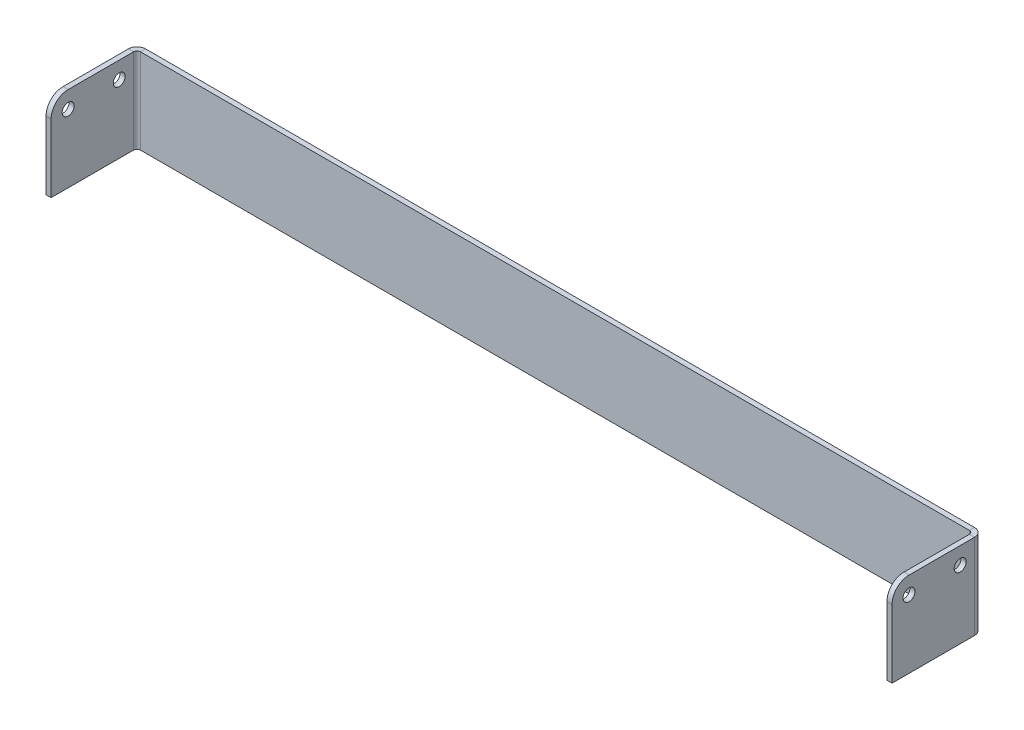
ISO-10303-21;
HEADER;
FILE_DESCRIPTION(('STEP AP214'),'2;1');
FILE_NAME('part.step','',(''),(''),'','','');
FILE_SCHEMA(('AUTOMOTIVE_DESIGN { 1 0 10303 214 1 1 1 1 }'));
ENDSEC;
DATA;
#1=APPLICATION_CONTEXT('core data for automotive mechanical design processes');
#2=APPLICATION_PROTOCOL_DEFINITION('international standard','automotive_design',2000,#1);
#3=PRODUCT_CONTEXT('',#1,'mechanical');
#4=PRODUCT('Part','Part','',(#3));
#5=PRODUCT_RELATED_PRODUCT_CATEGORY('part','',(#4));
#6=PRODUCT_DEFINITION_FORMATION('','',#4);
#7=PRODUCT_DEFINITION_CONTEXT('part definition',#1,'design');
#8=PRODUCT_DEFINITION('design','',#6,#7);
#9=PRODUCT_DEFINITION_SHAPE('','',#8);
#10=(LENGTH_UNIT() NAMED_UNIT(*) SI_UNIT(.MILLI.,.METRE.));
#11=(NAMED_UNIT(*) PLANE_ANGLE_UNIT() SI_UNIT($,.RADIAN.));
#12=(NAMED_UNIT(*) SI_UNIT($,.STERADIAN.) SOLID_ANGLE_UNIT());
#13=UNCERTAINTY_MEASURE_WITH_UNIT(LENGTH_MEASURE(1.E-05),#10,'distance_accuracy_value','');
#14=(GEOMETRIC_REPRESENTATION_CONTEXT(3) GLOBAL_UNCERTAINTY_ASSIGNED_CONTEXT((#13)) GLOBAL_UNIT_ASSIGNED_CONTEXT((#10,
#11,#12)) REPRESENTATION_CONTEXT('',''));
#15=CARTESIAN_POINT('',(0.,0.,0.));
#16=DIRECTION('',(0.,0.,1.));
#17=DIRECTION('',(1.,0.,0.));
#18=AXIS2_PLACEMENT_3D('',#15,#16,#17);
#19=CARTESIAN_POINT('',(5.,20.,0.));
#20=DIRECTION('',(0.,0.,-1.));
#21=DIRECTION('',(-1.,0.,0.));
#22=AXIS2_PLACEMENT_3D('',#19,#20,#21);
#23=PLANE('',#22);
#24=DIRECTION('',(-1.,0.,0.));
#25=VECTOR('',#24,1.);
#26=CARTESIAN_POINT('',(5.00000000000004,25.,0.));
#27=LINE('',#26,#25);
#28=CARTESIAN_POINT('',(269.21459005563,25.,0.));
#29=VERTEX_POINT('',#28);
#30=CARTESIAN_POINT('',(25.7854099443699,25.,0.));
#31=VERTEX_POINT('',#30);
#32=EDGE_CURVE('E58',#29,#31,#27,.T.);
#33=ORIENTED_EDGE('',*,*,#32,.F.);
#34=DIRECTION('',(0.,-1.,0.));
#35=VECTOR('',#34,1.);
#36=CARTESIAN_POINT('',(269.21459005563,20.,0.));
#37=LINE('',#36,#35);
#38=CARTESIAN_POINT('',(269.21459005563,0.,0.));
#39=VERTEX_POINT('',#38);
#40=EDGE_CURVE('E50',#29,#39,#37,.T.);
#41=ORIENTED_EDGE('',*,*,#40,.T.);
#42=DIRECTION('',(1.,0.,0.));
#43=VECTOR('',#42,1.);
#44=CARTESIAN_POINT('',(0.,0.,0.));
#45=LINE('',#44,#43);
#46=CARTESIAN_POINT('',(25.7854099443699,0.,0.));
#47=VERTEX_POINT('',#46);
#48=EDGE_CURVE('E66',#47,#39,#45,.T.);
#49=ORIENTED_EDGE('',*,*,#48,.F.);
#50=DIRECTION('',(0.,-1.,0.));
#51=VECTOR('',#50,1.);
#52=CARTESIAN_POINT('',(25.7854099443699,20.,0.));
#53=LINE('',#52,#51);
#54=EDGE_CURVE('E264',#31,#47,#53,.T.);
#55=ORIENTED_EDGE('',*,*,#54,.F.);
#56=EDGE_LOOP('',(#33,#41,#49,#55));
#57=FACE_BOUND('',#56,.T.);
#58=ADVANCED_FACE('F41',(#57),#23,.T.);
#59=CARTESIAN_POINT('',(5.00000000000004,25.,1.5));
#60=DIRECTION('',(0.,-1.,0.));
#61=DIRECTION('',(0.,0.,-1.));
#62=AXIS2_PLACEMENT_3D('',#59,#60,#61);
#63=PLANE('',#62);
#64=DIRECTION('',(0.,0.,1.));
#65=VECTOR('',#64,1.);
#66=CARTESIAN_POINT('',(269.21459005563,25.,1.5));
#67=LINE('',#66,#65);
#68=CARTESIAN_POINT('',(269.21459005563,25.,1.5));
#69=VERTEX_POINT('',#68);
#70=EDGE_CURVE('E12',#29,#69,#67,.T.);
#71=ORIENTED_EDGE('',*,*,#70,.F.);
#72=ORIENTED_EDGE('',*,*,#32,.T.);
#73=DIRECTION('',(0.,0.,1.));
#74=VECTOR('',#73,1.);
#75=CARTESIAN_POINT('',(25.7854099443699,25.,1.5));
#76=LINE('',#75,#74);
#77=CARTESIAN_POINT('',(25.7854099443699,25.,1.5));
#78=VERTEX_POINT('',#77);
#79=EDGE_CURVE('E261',#31,#78,#76,.T.);
#80=ORIENTED_EDGE('',*,*,#79,.T.);
#81=DIRECTION('',(-1.,0.,0.));
#82=VECTOR('',#81,1.);
#83=CARTESIAN_POINT('',(5.00000000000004,25.,1.5));
#84=LINE('',#83,#82);
#85=EDGE_CURVE('E45',#69,#78,#84,.T.);
#86=ORIENTED_EDGE('',*,*,#85,.F.);
#87=EDGE_LOOP('',(#71,#72,#80,#86));
#88=FACE_BOUND('',#87,.T.);
#89=ADVANCED_FACE('F43',(#88),#63,.F.);
#90=CARTESIAN_POINT('',(0.,0.,1.5));
#91=DIRECTION('',(0.,1.,0.));
#92=DIRECTION('',(0.,0.,1.));
#93=AXIS2_PLACEMENT_3D('',#90,#91,#92);
#94=PLANE('',#93);
#95=DIRECTION('',(0.,0.,-1.));
#96=VECTOR('',#95,1.);
#97=CARTESIAN_POINT('',(269.21459005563,0.,1.5));
#98=LINE('',#97,#96);
#99=CARTESIAN_POINT('',(269.21459005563,0.,1.5));
#100=VERTEX_POINT('',#99);
#101=EDGE_CURVE('E271',#100,#39,#98,.T.);
#102=ORIENTED_EDGE('',*,*,#101,.F.);
#103=DIRECTION('',(1.,0.,0.));
#104=VECTOR('',#103,1.);
#105=CARTESIAN_POINT('',(0.,0.,1.5));
#106=LINE('',#105,#104);
#107=CARTESIAN_POINT('',(25.7854099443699,0.,1.5));
#108=VERTEX_POINT('',#107);
#109=EDGE_CURVE('E276',#108,#100,#106,.T.);
#110=ORIENTED_EDGE('',*,*,#109,.F.);
#111=DIRECTION('',(0.,0.,-1.));
#112=VECTOR('',#111,1.);
#113=CARTESIAN_POINT('',(25.7854099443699,0.,1.5));
#114=LINE('',#113,#112);
#115=EDGE_CURVE('E266',#108,#47,#114,.T.);
#116=ORIENTED_EDGE('',*,*,#115,.T.);
#117=ORIENTED_EDGE('',*,*,#48,.T.);
#118=EDGE_LOOP('',(#102,#110,#116,#117));
#119=FACE_BOUND('',#118,.T.);
#120=ADVANCED_FACE('F323',(#119),#94,.F.);
#121=CARTESIAN_POINT('',(5.,20.,1.5));
#122=DIRECTION('',(0.,0.,-1.));
#123=DIRECTION('',(-1.,0.,0.));
#124=AXIS2_PLACEMENT_3D('',#121,#122,#123);
#125=PLANE('',#124);
#126=DIRECTION('',(0.,-1.,0.));
#127=VECTOR('',#126,1.);
#128=CARTESIAN_POINT('',(269.21459005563,20.,1.5));
#129=LINE('',#128,#127);
#130=EDGE_CURVE('E268',#69,#100,#129,.T.);
#131=ORIENTED_EDGE('',*,*,#130,.F.);
#132=ORIENTED_EDGE('',*,*,#85,.T.);
#133=DIRECTION('',(0.,-1.,0.));
#134=VECTOR('',#133,1.);
#135=CARTESIAN_POINT('',(25.7854099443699,20.,1.5));
#136=LINE('',#135,#134);
#137=EDGE_CURVE('E258',#78,#108,#136,.T.);
#138=ORIENTED_EDGE('',*,*,#137,.T.);
#139=ORIENTED_EDGE('',*,*,#109,.T.);
#140=EDGE_LOOP('',(#131,#132,#138,#139));
#141=FACE_BOUND('',#140,.T.);
#142=ADVANCED_FACE('F281',(#141),#125,.F.);
#143=CARTESIAN_POINT('',(25.7854099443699,25.,2.5));
#144=DIRECTION('',(0.,-1.,0.));
#145=DIRECTION('',(0.,0.,-1.));
#146=AXIS2_PLACEMENT_3D('',#143,#144,#145);
#147=PLANE('',#146);
#148=ORIENTED_EDGE('',*,*,#79,.F.);
#149=CARTESIAN_POINT('',(25.7854099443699,25.,2.5));
#150=DIRECTION('',(0.,-1.,0.));
#151=DIRECTION('',(1.,0.,0.));
#152=AXIS2_PLACEMENT_3D('',#149,#150,#151);
#153=CIRCLE('',#152,2.5);
#154=CARTESIAN_POINT('',(23.2854099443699,25.,2.50000000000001));
#155=VERTEX_POINT('',#154);
#156=EDGE_CURVE('E197',#31,#155,#153,.F.);
#157=ORIENTED_EDGE('',*,*,#156,.T.);
#158=DIRECTION('',(1.,0.,0.));
#159=VECTOR('',#158,1.);
#160=CARTESIAN_POINT('',(24.7854099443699,25.,2.5));
#161=LINE('',#160,#159);
#162=CARTESIAN_POINT('',(24.7854099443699,25.,2.5));
#163=VERTEX_POINT('',#162);
#164=EDGE_CURVE('E239',#155,#163,#161,.T.);
#165=ORIENTED_EDGE('',*,*,#164,.T.);
#166=CARTESIAN_POINT('',(25.7854099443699,25.,2.5));
#167=DIRECTION('',(0.,1.,0.));
#168=DIRECTION('',(0.,0.,1.));
#169=AXIS2_PLACEMENT_3D('',#166,#167,#168);
#170=CIRCLE('',#169,1.);
#171=EDGE_CURVE('E247',#78,#163,#170,.T.);
#172=ORIENTED_EDGE('',*,*,#171,.F.);
#173=EDGE_LOOP('',(#148,#157,#165,#172));
#174=FACE_BOUND('',#173,.T.);
#175=ADVANCED_FACE('F286',(#174),#147,.F.);
#176=CARTESIAN_POINT('',(25.7854099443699,0.,2.5));
#177=DIRECTION('',(0.,1.,0.));
#178=DIRECTION('',(-1.,0.,0.));
#179=AXIS2_PLACEMENT_3D('',#176,#177,#178);
#180=PLANE('',#179);
#181=DIRECTION('',(-1.,0.,0.));
#182=VECTOR('',#181,1.);
#183=CARTESIAN_POINT('',(24.7854099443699,0.,2.5));
#184=LINE('',#183,#182);
#185=CARTESIAN_POINT('',(24.7854099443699,0.,2.50000000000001));
#186=VERTEX_POINT('',#185);
#187=CARTESIAN_POINT('',(23.2854099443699,0.,2.50000000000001));
#188=VERTEX_POINT('',#187);
#189=EDGE_CURVE('E242',#186,#188,#184,.T.);
#190=ORIENTED_EDGE('',*,*,#189,.T.);
#191=CARTESIAN_POINT('',(25.7854099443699,0.,2.5));
#192=DIRECTION('',(0.,-1.,0.));
#193=DIRECTION('',(1.,0.,0.));
#194=AXIS2_PLACEMENT_3D('',#191,#192,#193);
#195=CIRCLE('',#194,2.5);
#196=EDGE_CURVE('E251',#188,#47,#195,.T.);
#197=ORIENTED_EDGE('',*,*,#196,.T.);
#198=ORIENTED_EDGE('',*,*,#115,.F.);
#199=CARTESIAN_POINT('',(25.7854099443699,0.,2.5));
#200=DIRECTION('',(0.,-1.,0.));
#201=DIRECTION('',(1.,0.,0.));
#202=AXIS2_PLACEMENT_3D('',#199,#200,#201);
#203=CIRCLE('',#202,1.);
#204=EDGE_CURVE('E250',#186,#108,#203,.T.);
#205=ORIENTED_EDGE('',*,*,#204,.F.);
#206=EDGE_LOOP('',(#190,#197,#198,#205));
#207=FACE_BOUND('',#206,.T.);
#208=ADVANCED_FACE('F298',(#207),#180,.F.);
#209=CARTESIAN_POINT('',(25.7854099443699,37.5941721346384,2.5));
#210=DIRECTION('',(0.,-1.,0.));
#211=DIRECTION('',(1.,0.,0.));
#212=AXIS2_PLACEMENT_3D('',#209,#210,#211);
#213=CYLINDRICAL_SURFACE('',#212,1.);
#214=ORIENTED_EDGE('',*,*,#204,.T.);
#215=ORIENTED_EDGE('',*,*,#137,.F.);
#216=ORIENTED_EDGE('',*,*,#171,.T.);
#217=DIRECTION('',(0.,-1.,0.));
#218=VECTOR('',#217,1.);
#219=CARTESIAN_POINT('',(24.7854099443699,20.,2.5));
#220=LINE('',#219,#218);
#221=EDGE_CURVE('E189',#163,#186,#220,.T.);
#222=ORIENTED_EDGE('',*,*,#221,.T.);
#223=EDGE_LOOP('',(#214,#215,#216,#222));
#224=FACE_BOUND('',#223,.T.);
#225=ADVANCED_FACE('F308',(#224),#213,.F.);
#226=CARTESIAN_POINT('',(25.7854099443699,37.5941721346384,2.5));
#227=DIRECTION('',(0.,-1.,0.));
#228=DIRECTION('',(1.,0.,0.));
#229=AXIS2_PLACEMENT_3D('',#226,#227,#228);
#230=CYLINDRICAL_SURFACE('',#229,2.5);
#231=ORIENTED_EDGE('',*,*,#196,.F.);
#232=DIRECTION('',(0.,-1.,0.));
#233=VECTOR('',#232,1.);
#234=CARTESIAN_POINT('',(23.2854099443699,20.,2.50000000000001));
#235=LINE('',#234,#233);
#236=EDGE_CURVE('E201',#155,#188,#235,.T.);
#237=ORIENTED_EDGE('',*,*,#236,.F.);
#238=ORIENTED_EDGE('',*,*,#156,.F.);
#239=ORIENTED_EDGE('',*,*,#54,.T.);
#240=EDGE_LOOP('',(#231,#237,#238,#239));
#241=FACE_BOUND('',#240,.T.);
#242=ADVANCED_FACE('F290',(#241),#230,.T.);
#243=CARTESIAN_POINT('',(24.7854099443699,20.,6.71459005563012));
#244=DIRECTION('',(-1.,0.,0.));
#245=DIRECTION('',(0.,0.,1.));
#246=AXIS2_PLACEMENT_3D('',#243,#244,#245);
#247=CYLINDRICAL_SURFACE('',#246,1.75);
#248=CARTESIAN_POINT('',(24.7854099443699,20.,6.71459005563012));
#249=DIRECTION('',(1.,0.,0.));
#250=DIRECTION('',(0.,0.,-1.));
#251=AXIS2_PLACEMENT_3D('',#248,#249,#250);
#252=CIRCLE('',#251,1.75);
#253=CARTESIAN_POINT('',(24.7854099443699,20.,4.96459005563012));
#254=VERTEX_POINT('',#253);
#255=EDGE_CURVE('E236',#254,#254,#252,.T.);
#256=ORIENTED_EDGE('',*,*,#255,.T.);
#257=EDGE_LOOP('',(#256));
#258=FACE_BOUND('',#257,.T.);
#259=CARTESIAN_POINT('',(23.2854099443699,20.,6.71459005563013));
#260=DIRECTION('',(1.,0.,0.));
#261=DIRECTION('',(0.,0.,-1.));
#262=AXIS2_PLACEMENT_3D('',#259,#260,#261);
#263=CIRCLE('',#262,1.75);
#264=CARTESIAN_POINT('',(23.2854099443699,20.,4.96459005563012));
#265=VERTEX_POINT('',#264);
#266=EDGE_CURVE('E204',#265,#265,#263,.T.);
#267=ORIENTED_EDGE('',*,*,#266,.F.);
#268=EDGE_LOOP('',(#267));
#269=FACE_BOUND('',#268,.T.);
#270=ADVANCED_FACE('F315',(#258,#269),#247,.F.);
#271=CARTESIAN_POINT('',(24.78540994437,20.,21.7145900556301));
#272=DIRECTION('',(-1.,0.,0.));
#273=DIRECTION('',(0.,0.,1.));
#274=AXIS2_PLACEMENT_3D('',#271,#272,#273);
#275=CYLINDRICAL_SURFACE('',#274,1.75);
#276=CARTESIAN_POINT('',(24.78540994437,20.,21.7145900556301));
#277=DIRECTION('',(1.,0.,0.));
#278=DIRECTION('',(0.,0.,-1.));
#279=AXIS2_PLACEMENT_3D('',#276,#277,#278);
#280=CIRCLE('',#279,1.75);
#281=CARTESIAN_POINT('',(24.78540994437,20.,19.9645900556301));
#282=VERTEX_POINT('',#281);
#283=EDGE_CURVE('E233',#282,#282,#280,.T.);
#284=ORIENTED_EDGE('',*,*,#283,.T.);
#285=EDGE_LOOP('',(#284));
#286=FACE_BOUND('',#285,.T.);
#287=CARTESIAN_POINT('',(23.28540994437,20.,21.7145900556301));
#288=DIRECTION('',(1.,0.,0.));
#289=DIRECTION('',(0.,0.,-1.));
#290=AXIS2_PLACEMENT_3D('',#287,#288,#289);
#291=CIRCLE('',#290,1.75);
#292=CARTESIAN_POINT('',(23.28540994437,20.,19.9645900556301));
#293=VERTEX_POINT('',#292);
#294=EDGE_CURVE('E207',#293,#293,#291,.T.);
#295=ORIENTED_EDGE('',*,*,#294,.F.);
#296=EDGE_LOOP('',(#295));
#297=FACE_BOUND('',#296,.T.);
#298=ADVANCED_FACE('F361',(#286,#297),#275,.F.);
#299=CARTESIAN_POINT('',(24.78540994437,0.,26.7145900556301));
#300=DIRECTION('',(0.,0.,-1.));
#301=DIRECTION('',(-1.,0.,0.));
#302=AXIS2_PLACEMENT_3D('',#299,#300,#301);
#303=PLANE('',#302);
#304=DIRECTION('',(0.,-1.,0.));
#305=VECTOR('',#304,1.);
#306=CARTESIAN_POINT('',(23.28540994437,0.,26.7145900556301));
#307=LINE('',#306,#305);
#308=CARTESIAN_POINT('',(23.28540994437,19.9999999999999,26.7145900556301));
#309=VERTEX_POINT('',#308);
#310=CARTESIAN_POINT('',(23.28540994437,0.,26.7145900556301));
#311=VERTEX_POINT('',#310);
#312=EDGE_CURVE('E230',#309,#311,#307,.T.);
#313=ORIENTED_EDGE('',*,*,#312,.T.);
#314=DIRECTION('',(-1.,0.,0.));
#315=VECTOR('',#314,1.);
#316=CARTESIAN_POINT('',(24.78540994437,0.,26.7145900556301));
#317=LINE('',#316,#315);
#318=CARTESIAN_POINT('',(24.78540994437,0.,26.7145900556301));
#319=VERTEX_POINT('',#318);
#320=EDGE_CURVE('E198',#319,#311,#317,.T.);
#321=ORIENTED_EDGE('',*,*,#320,.F.);
#322=DIRECTION('',(0.,-1.,0.));
#323=VECTOR('',#322,1.);
#324=CARTESIAN_POINT('',(24.78540994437,0.,26.7145900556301));
#325=LINE('',#324,#323);
#326=CARTESIAN_POINT('',(24.78540994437,19.9999999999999,26.7145900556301));
#327=VERTEX_POINT('',#326);
#328=EDGE_CURVE('E215',#327,#319,#325,.T.);
#329=ORIENTED_EDGE('',*,*,#328,.F.);
#330=DIRECTION('',(-1.,0.,0.));
#331=VECTOR('',#330,1.);
#332=CARTESIAN_POINT('',(24.78540994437,19.9999999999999,26.7145900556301));
#333=LINE('',#332,#331);
#334=EDGE_CURVE('E227',#327,#309,#333,.T.);
#335=ORIENTED_EDGE('',*,*,#334,.T.);
#336=EDGE_LOOP('',(#313,#321,#329,#335));
#337=FACE_BOUND('',#336,.T.);
#338=ADVANCED_FACE('F373',(#337),#303,.F.);
#339=CARTESIAN_POINT('',(24.78540994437,20.,21.7145900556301));
#340=DIRECTION('',(-1.,0.,0.));
#341=DIRECTION('',(0.,0.,1.));
#342=AXIS2_PLACEMENT_3D('',#339,#340,#341);
#343=CYLINDRICAL_SURFACE('',#342,5.);
#344=CARTESIAN_POINT('',(23.28540994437,20.,21.7145900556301));
#345=DIRECTION('',(1.,0.,0.));
#346=DIRECTION('',(0.,0.,1.));
#347=AXIS2_PLACEMENT_3D('',#344,#345,#346);
#348=CIRCLE('',#347,5.);
#349=CARTESIAN_POINT('',(23.28540994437,25.,21.7145900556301));
#350=VERTEX_POINT('',#349);
#351=EDGE_CURVE('E225',#350,#309,#348,.T.);
#352=ORIENTED_EDGE('',*,*,#351,.T.);
#353=ORIENTED_EDGE('',*,*,#334,.F.);
#354=CARTESIAN_POINT('',(24.78540994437,20.,21.7145900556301));
#355=DIRECTION('',(1.,0.,0.));
#356=DIRECTION('',(0.,0.,1.));
#357=AXIS2_PLACEMENT_3D('',#354,#355,#356);
#358=CIRCLE('',#357,5.);
#359=CARTESIAN_POINT('',(24.78540994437,25.,21.7145900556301));
#360=VERTEX_POINT('',#359);
#361=EDGE_CURVE('E218',#360,#327,#358,.T.);
#362=ORIENTED_EDGE('',*,*,#361,.F.);
#363=DIRECTION('',(-1.,0.,0.));
#364=VECTOR('',#363,1.);
#365=CARTESIAN_POINT('',(24.78540994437,25.,21.7145900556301));
#366=LINE('',#365,#364);
#367=EDGE_CURVE('E222',#360,#350,#366,.T.);
#368=ORIENTED_EDGE('',*,*,#367,.T.);
#369=EDGE_LOOP('',(#352,#353,#362,#368));
#370=FACE_BOUND('',#369,.T.);
#371=ADVANCED_FACE('F384',(#370),#343,.T.);
#372=CARTESIAN_POINT('',(24.78540994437,20.,21.7145900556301));
#373=DIRECTION('',(-1.,0.,0.));
#374=DIRECTION('',(0.,0.,1.));
#375=AXIS2_PLACEMENT_3D('',#372,#373,#374);
#376=PLANE('',#375);
#377=ORIENTED_EDGE('',*,*,#221,.F.);
#378=DIRECTION('',(0.,0.,1.));
#379=VECTOR('',#378,1.);
#380=CARTESIAN_POINT('',(24.78540994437,25.,21.7145900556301));
#381=LINE('',#380,#379);
#382=EDGE_CURVE('E220',#163,#360,#381,.T.);
#383=ORIENTED_EDGE('',*,*,#382,.T.);
#384=ORIENTED_EDGE('',*,*,#361,.T.);
#385=ORIENTED_EDGE('',*,*,#328,.T.);
#386=DIRECTION('',(0.,0.,-1.));
#387=VECTOR('',#386,1.);
#388=CARTESIAN_POINT('',(24.78540994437,0.,26.7145900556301));
#389=LINE('',#388,#387);
#390=EDGE_CURVE('E212',#319,#186,#389,.T.);
#391=ORIENTED_EDGE('',*,*,#390,.T.);
#392=EDGE_LOOP('',(#377,#383,#384,#385,#391));
#393=FACE_BOUND('',#392,.T.);
#394=ORIENTED_EDGE('',*,*,#283,.F.);
#395=EDGE_LOOP('',(#394));
#396=FACE_BOUND('',#395,.T.);
#397=ORIENTED_EDGE('',*,*,#255,.F.);
#398=EDGE_LOOP('',(#397));
#399=FACE_BOUND('',#398,.T.);
#400=ADVANCED_FACE('F302',(#393,#396,#399),#376,.F.);
#401=CARTESIAN_POINT('',(24.78540994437,25.,21.7145900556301));
#402=DIRECTION('',(0.,-1.,0.));
#403=DIRECTION('',(-1.,0.,0.));
#404=AXIS2_PLACEMENT_3D('',#401,#402,#403);
#405=PLANE('',#404);
#406=ORIENTED_EDGE('',*,*,#164,.F.);
#407=DIRECTION('',(0.,0.,1.));
#408=VECTOR('',#407,1.);
#409=CARTESIAN_POINT('',(23.28540994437,25.,21.7145900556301));
#410=LINE('',#409,#408);
#411=EDGE_CURVE('E210',#155,#350,#410,.T.);
#412=ORIENTED_EDGE('',*,*,#411,.T.);
#413=ORIENTED_EDGE('',*,*,#367,.F.);
#414=ORIENTED_EDGE('',*,*,#382,.F.);
#415=EDGE_LOOP('',(#406,#412,#413,#414));
#416=FACE_BOUND('',#415,.T.);
#417=ADVANCED_FACE('F405',(#416),#405,.F.);
#418=CARTESIAN_POINT('',(23.28540994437,20.,21.7145900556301));
#419=DIRECTION('',(-1.,0.,0.));
#420=DIRECTION('',(0.,0.,1.));
#421=AXIS2_PLACEMENT_3D('',#418,#419,#420);
#422=PLANE('',#421);
#423=ORIENTED_EDGE('',*,*,#294,.T.);
#424=EDGE_LOOP('',(#423));
#425=FACE_BOUND('',#424,.T.);
#426=ORIENTED_EDGE('',*,*,#266,.T.);
#427=EDGE_LOOP('',(#426));
#428=FACE_BOUND('',#427,.T.);
#429=ORIENTED_EDGE('',*,*,#411,.F.);
#430=ORIENTED_EDGE('',*,*,#236,.T.);
#431=DIRECTION('',(0.,0.,-1.));
#432=VECTOR('',#431,1.);
#433=CARTESIAN_POINT('',(23.28540994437,0.,26.7145900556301));
#434=LINE('',#433,#432);
#435=EDGE_CURVE('E195',#311,#188,#434,.T.);
#436=ORIENTED_EDGE('',*,*,#435,.F.);
#437=ORIENTED_EDGE('',*,*,#312,.F.);
#438=ORIENTED_EDGE('',*,*,#351,.F.);
#439=EDGE_LOOP('',(#429,#430,#436,#437,#438));
#440=FACE_BOUND('',#439,.T.);
#441=ADVANCED_FACE('F292',(#425,#428,#440),#422,.T.);
#442=CARTESIAN_POINT('',(24.78540994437,0.,26.7145900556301));
#443=DIRECTION('',(0.,1.,0.));
#444=DIRECTION('',(1.,0.,0.));
#445=AXIS2_PLACEMENT_3D('',#442,#443,#444);
#446=PLANE('',#445);
#447=ORIENTED_EDGE('',*,*,#189,.F.);
#448=ORIENTED_EDGE('',*,*,#390,.F.);
#449=ORIENTED_EDGE('',*,*,#320,.T.);
#450=ORIENTED_EDGE('',*,*,#435,.T.);
#451=EDGE_LOOP('',(#447,#448,#449,#450));
#452=FACE_BOUND('',#451,.T.);
#453=ADVANCED_FACE('F300',(#452),#446,.F.);
#454=CARTESIAN_POINT('',(269.21459005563,25.,2.5));
#455=DIRECTION('',(0.,-1.,0.));
#456=DIRECTION('',(0.,0.,-1.));
#457=AXIS2_PLACEMENT_3D('',#454,#455,#456);
#458=PLANE('',#457);
#459=DIRECTION('',(-1.,0.,0.));
#460=VECTOR('',#459,1.);
#461=CARTESIAN_POINT('',(270.21459005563,25.,2.5));
#462=LINE('',#461,#460);
#463=CARTESIAN_POINT('',(271.71459005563,25.,2.5));
#464=VERTEX_POINT('',#463);
#465=CARTESIAN_POINT('',(270.21459005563,25.,2.5));
#466=VERTEX_POINT('',#465);
#467=EDGE_CURVE('E622',#464,#466,#462,.T.);
#468=ORIENTED_EDGE('',*,*,#467,.F.);
#469=CARTESIAN_POINT('',(269.21459005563,25.,2.5));
#470=DIRECTION('',(0.,1.,0.));
#471=DIRECTION('',(0.,0.,1.));
#472=AXIS2_PLACEMENT_3D('',#469,#470,#471);
#473=CIRCLE('',#472,2.5);
#474=EDGE_CURVE('E191',#464,#29,#473,.T.);
#475=ORIENTED_EDGE('',*,*,#474,.T.);
#476=ORIENTED_EDGE('',*,*,#70,.T.);
#477=CARTESIAN_POINT('',(269.21459005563,25.,2.5));
#478=DIRECTION('',(0.,1.,0.));
#479=DIRECTION('',(0.,0.,1.));
#480=AXIS2_PLACEMENT_3D('',#477,#478,#479);
#481=CIRCLE('',#480,1.);
#482=EDGE_CURVE('E182',#466,#69,#481,.T.);
#483=ORIENTED_EDGE('',*,*,#482,.F.);
#484=EDGE_LOOP('',(#468,#475,#476,#483));
#485=FACE_BOUND('',#484,.T.);
#486=ADVANCED_FACE('F435',(#485),#458,.F.);
#487=CARTESIAN_POINT('',(269.21459005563,0.,2.5));
#488=DIRECTION('',(0.,1.,0.));
#489=DIRECTION('',(0.,0.,1.));
#490=AXIS2_PLACEMENT_3D('',#487,#488,#489);
#491=PLANE('',#490);
#492=ORIENTED_EDGE('',*,*,#101,.T.);
#493=CARTESIAN_POINT('',(269.21459005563,0.,2.5));
#494=DIRECTION('',(0.,1.,0.));
#495=DIRECTION('',(0.,0.,1.));
#496=AXIS2_PLACEMENT_3D('',#493,#494,#495);
#497=CIRCLE('',#496,2.5);
#498=CARTESIAN_POINT('',(271.71459005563,0.,2.5));
#499=VERTEX_POINT('',#498);
#500=EDGE_CURVE('E186',#39,#499,#497,.F.);
#501=ORIENTED_EDGE('',*,*,#500,.T.);
#502=DIRECTION('',(1.,0.,0.));
#503=VECTOR('',#502,1.);
#504=CARTESIAN_POINT('',(270.21459005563,0.,2.5));
#505=LINE('',#504,#503);
#506=CARTESIAN_POINT('',(270.21459005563,0.,2.49999999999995));
#507=VERTEX_POINT('',#506);
#508=EDGE_CURVE('E153',#507,#499,#505,.T.);
#509=ORIENTED_EDGE('',*,*,#508,.F.);
#510=CARTESIAN_POINT('',(269.21459005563,0.,2.5));
#511=DIRECTION('',(0.,-1.,0.));
#512=DIRECTION('',(0.,0.,-1.));
#513=AXIS2_PLACEMENT_3D('',#510,#511,#512);
#514=CIRCLE('',#513,1.);
#515=EDGE_CURVE('E185',#100,#507,#514,.T.);
#516=ORIENTED_EDGE('',*,*,#515,.F.);
#517=EDGE_LOOP('',(#492,#501,#509,#516));
#518=FACE_BOUND('',#517,.T.);
#519=ADVANCED_FACE('F444',(#518),#491,.F.);
#520=CARTESIAN_POINT('',(269.21459005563,-12.5941721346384,2.5));
#521=DIRECTION('',(0.,1.,0.));
#522=DIRECTION('',(0.,0.,1.));
#523=AXIS2_PLACEMENT_3D('',#520,#521,#522);
#524=CYLINDRICAL_SURFACE('',#523,1.);
#525=ORIENTED_EDGE('',*,*,#515,.T.);
#526=DIRECTION('',(0.,-1.,0.));
#527=VECTOR('',#526,1.);
#528=CARTESIAN_POINT('',(270.21459005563,20.,2.5));
#529=LINE('',#528,#527);
#530=EDGE_CURVE('E634',#466,#507,#529,.T.);
#531=ORIENTED_EDGE('',*,*,#530,.F.);
#532=ORIENTED_EDGE('',*,*,#482,.T.);
#533=ORIENTED_EDGE('',*,*,#130,.T.);
#534=EDGE_LOOP('',(#525,#531,#532,#533));
#535=FACE_BOUND('',#534,.T.);
#536=ADVANCED_FACE('F455',(#535),#524,.F.);
#537=CARTESIAN_POINT('',(269.21459005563,-12.5941721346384,2.5));
#538=DIRECTION('',(0.,1.,0.));
#539=DIRECTION('',(0.,0.,1.));
#540=AXIS2_PLACEMENT_3D('',#537,#538,#539);
#541=CYLINDRICAL_SURFACE('',#540,2.5);
#542=ORIENTED_EDGE('',*,*,#500,.F.);
#543=ORIENTED_EDGE('',*,*,#40,.F.);
#544=ORIENTED_EDGE('',*,*,#474,.F.);
#545=DIRECTION('',(0.,-1.,0.));
#546=VECTOR('',#545,1.);
#547=CARTESIAN_POINT('',(271.71459005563,20.,2.5));
#548=LINE('',#547,#546);
#549=EDGE_CURVE('E179',#464,#499,#548,.T.);
#550=ORIENTED_EDGE('',*,*,#549,.T.);
#551=EDGE_LOOP('',(#542,#543,#544,#550));
#552=FACE_BOUND('',#551,.T.);
#553=ADVANCED_FACE('F466',(#552),#541,.T.);
#554=CARTESIAN_POINT('',(270.21459005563,20.,21.7145900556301));
#555=DIRECTION('',(1.,0.,0.));
#556=DIRECTION('',(0.,0.,-1.));
#557=AXIS2_PLACEMENT_3D('',#554,#555,#556);
#558=CYLINDRICAL_SURFACE('',#557,5.);
#559=CARTESIAN_POINT('',(271.71459005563,20.,21.7145900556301));
#560=DIRECTION('',(-1.,0.,0.));
#561=DIRECTION('',(0.,0.,1.));
#562=AXIS2_PLACEMENT_3D('',#559,#560,#561);
#563=CIRCLE('',#562,5.);
#564=CARTESIAN_POINT('',(271.71459005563,20.,26.7145900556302));
#565=VERTEX_POINT('',#564);
#566=CARTESIAN_POINT('',(271.71459005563,25.,21.7145900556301));
#567=VERTEX_POINT('',#566);
#568=EDGE_CURVE('E172',#565,#567,#563,.T.);
#569=ORIENTED_EDGE('',*,*,#568,.T.);
#570=DIRECTION('',(1.,0.,0.));
#571=VECTOR('',#570,1.);
#572=CARTESIAN_POINT('',(270.21459005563,25.,21.7145900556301));
#573=LINE('',#572,#571);
#574=CARTESIAN_POINT('',(270.21459005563,25.,21.7145900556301));
#575=VERTEX_POINT('',#574);
#576=EDGE_CURVE('E194',#575,#567,#573,.T.);
#577=ORIENTED_EDGE('',*,*,#576,.F.);
#578=CARTESIAN_POINT('',(270.21459005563,20.,21.7145900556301));
#579=DIRECTION('',(-1.,0.,0.));
#580=DIRECTION('',(0.,0.,1.));
#581=AXIS2_PLACEMENT_3D('',#578,#579,#580);
#582=CIRCLE('',#581,5.);
#583=CARTESIAN_POINT('',(270.21459005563,20.,26.7145900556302));
#584=VERTEX_POINT('',#583);
#585=EDGE_CURVE('E650',#584,#575,#582,.T.);
#586=ORIENTED_EDGE('',*,*,#585,.F.);
#587=DIRECTION('',(1.,0.,0.));
#588=VECTOR('',#587,1.);
#589=CARTESIAN_POINT('',(270.21459005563,20.,26.7145900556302));
#590=LINE('',#589,#588);
#591=EDGE_CURVE('E173',#584,#565,#590,.T.);
#592=ORIENTED_EDGE('',*,*,#591,.T.);
#593=EDGE_LOOP('',(#569,#577,#586,#592));
#594=FACE_BOUND('',#593,.T.);
#595=ADVANCED_FACE('F477',(#594),#558,.T.);
#596=CARTESIAN_POINT('',(270.21459005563,0.,26.7145900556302));
#597=DIRECTION('',(0.,0.,-1.));
#598=DIRECTION('',(-1.,0.,0.));
#599=AXIS2_PLACEMENT_3D('',#596,#597,#598);
#600=PLANE('',#599);
#601=DIRECTION('',(0.,1.,0.));
#602=VECTOR('',#601,1.);
#603=CARTESIAN_POINT('',(271.71459005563,0.,26.7145900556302));
#604=LINE('',#603,#602);
#605=CARTESIAN_POINT('',(271.71459005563,0.,26.7145900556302));
#606=VERTEX_POINT('',#605);
#607=EDGE_CURVE('E163',#606,#565,#604,.T.);
#608=ORIENTED_EDGE('',*,*,#607,.T.);
#609=ORIENTED_EDGE('',*,*,#591,.F.);
#610=DIRECTION('',(0.,1.,0.));
#611=VECTOR('',#610,1.);
#612=CARTESIAN_POINT('',(270.21459005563,0.,26.7145900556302));
#613=LINE('',#612,#611);
#614=CARTESIAN_POINT('',(270.21459005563,0.,26.7145900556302));
#615=VERTEX_POINT('',#614);
#616=EDGE_CURVE('E165',#615,#584,#613,.T.);
#617=ORIENTED_EDGE('',*,*,#616,.F.);
#618=DIRECTION('',(1.,0.,0.));
#619=VECTOR('',#618,1.);
#620=CARTESIAN_POINT('',(270.21459005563,0.,26.7145900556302));
#621=LINE('',#620,#619);
#622=EDGE_CURVE('E150',#615,#606,#621,.T.);
#623=ORIENTED_EDGE('',*,*,#622,.T.);
#624=EDGE_LOOP('',(#608,#609,#617,#623));
#625=FACE_BOUND('',#624,.T.);
#626=ADVANCED_FACE('F161',(#625),#600,.F.);
#627=CARTESIAN_POINT('',(270.21459005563,20.,6.71459005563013));
#628=DIRECTION('',(1.,0.,0.));
#629=DIRECTION('',(0.,0.,-1.));
#630=AXIS2_PLACEMENT_3D('',#627,#628,#629);
#631=CYLINDRICAL_SURFACE('',#630,1.74999999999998);
#632=CARTESIAN_POINT('',(270.21459005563,20.,6.71459005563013));
#633=DIRECTION('',(-1.,0.,0.));
#634=DIRECTION('',(0.,0.,1.));
#635=AXIS2_PLACEMENT_3D('',#632,#633,#634);
#636=CIRCLE('',#635,1.74999999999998);
#637=CARTESIAN_POINT('',(270.21459005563,20.,8.46459005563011));
#638=VERTEX_POINT('',#637);
#639=EDGE_CURVE('E166',#638,#638,#636,.T.);
#640=ORIENTED_EDGE('',*,*,#639,.T.);
#641=EDGE_LOOP('',(#640));
#642=FACE_BOUND('',#641,.T.);
#643=CARTESIAN_POINT('',(271.71459005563,20.,6.71459005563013));
#644=DIRECTION('',(-1.,0.,0.));
#645=DIRECTION('',(0.,0.,1.));
#646=AXIS2_PLACEMENT_3D('',#643,#644,#645);
#647=CIRCLE('',#646,1.74999999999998);
#648=CARTESIAN_POINT('',(271.71459005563,20.,8.46459005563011));
#649=VERTEX_POINT('',#648);
#650=EDGE_CURVE('E625',#649,#649,#647,.T.);
#651=ORIENTED_EDGE('',*,*,#650,.F.);
#652=EDGE_LOOP('',(#651));
#653=FACE_BOUND('',#652,.T.);
#654=ADVANCED_FACE('F498',(#642,#653),#631,.F.);
#655=CARTESIAN_POINT('',(270.21459005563,20.,21.7145900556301));
#656=DIRECTION('',(1.,0.,0.));
#657=DIRECTION('',(0.,0.,-1.));
#658=AXIS2_PLACEMENT_3D('',#655,#656,#657);
#659=CYLINDRICAL_SURFACE('',#658,1.74999999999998);
#660=CARTESIAN_POINT('',(270.21459005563,20.,21.7145900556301));
#661=DIRECTION('',(-1.,0.,0.));
#662=DIRECTION('',(0.,0.,1.));
#663=AXIS2_PLACEMENT_3D('',#660,#661,#662);
#664=CIRCLE('',#663,1.74999999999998);
#665=CARTESIAN_POINT('',(270.21459005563,20.,23.4645900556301));
#666=VERTEX_POINT('',#665);
#667=EDGE_CURVE('E640',#666,#666,#664,.T.);
#668=ORIENTED_EDGE('',*,*,#667,.T.);
#669=EDGE_LOOP('',(#668));
#670=FACE_BOUND('',#669,.T.);
#671=CARTESIAN_POINT('',(271.71459005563,20.,21.7145900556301));
#672=DIRECTION('',(-1.,0.,0.));
#673=DIRECTION('',(0.,0.,1.));
#674=AXIS2_PLACEMENT_3D('',#671,#672,#673);
#675=CIRCLE('',#674,1.74999999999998);
#676=CARTESIAN_POINT('',(271.71459005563,20.,23.4645900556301));
#677=VERTEX_POINT('',#676);
#678=EDGE_CURVE('E158',#677,#677,#675,.T.);
#679=ORIENTED_EDGE('',*,*,#678,.F.);
#680=EDGE_LOOP('',(#679));
#681=FACE_BOUND('',#680,.T.);
#682=ADVANCED_FACE('F508',(#670,#681),#659,.F.);
#683=CARTESIAN_POINT('',(270.214590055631,20.,-263.28540994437));
#684=DIRECTION('',(1.,0.,0.));
#685=DIRECTION('',(0.,0.,-1.));
#686=AXIS2_PLACEMENT_3D('',#683,#684,#685);
#687=PLANE('',#686);
#688=ORIENTED_EDGE('',*,*,#667,.F.);
#689=EDGE_LOOP('',(#688));
#690=FACE_BOUND('',#689,.T.);
#691=ORIENTED_EDGE('',*,*,#639,.F.);
#692=EDGE_LOOP('',(#691));
#693=FACE_BOUND('',#692,.T.);
#694=DIRECTION('',(0.,0.,-1.));
#695=VECTOR('',#694,1.);
#696=CARTESIAN_POINT('',(270.214590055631,25.,-263.28540994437));
#697=LINE('',#696,#695);
#698=EDGE_CURVE('E637',#575,#466,#697,.T.);
#699=ORIENTED_EDGE('',*,*,#698,.T.);
#700=ORIENTED_EDGE('',*,*,#530,.T.);
#701=DIRECTION('',(0.,0.,1.));
#702=VECTOR('',#701,1.);
#703=CARTESIAN_POINT('',(270.214590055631,0.,-268.28540994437));
#704=LINE('',#703,#702);
#705=EDGE_CURVE('E636',#507,#615,#704,.T.);
#706=ORIENTED_EDGE('',*,*,#705,.T.);
#707=ORIENTED_EDGE('',*,*,#616,.T.);
#708=ORIENTED_EDGE('',*,*,#585,.T.);
#709=EDGE_LOOP('',(#699,#700,#706,#707,#708));
#710=FACE_BOUND('',#709,.T.);
#711=ADVANCED_FACE('F519',(#690,#693,#710),#687,.F.);
#712=CARTESIAN_POINT('',(270.214590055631,0.,-268.28540994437));
#713=DIRECTION('',(0.,1.,0.));
#714=DIRECTION('',(-1.,0.,0.));
#715=AXIS2_PLACEMENT_3D('',#712,#713,#714);
#716=PLANE('',#715);
#717=ORIENTED_EDGE('',*,*,#705,.F.);
#718=ORIENTED_EDGE('',*,*,#508,.T.);
#719=DIRECTION('',(0.,0.,1.));
#720=VECTOR('',#719,1.);
#721=CARTESIAN_POINT('',(271.714590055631,0.,-268.28540994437));
#722=LINE('',#721,#720);
#723=EDGE_CURVE('E147',#499,#606,#722,.T.);
#724=ORIENTED_EDGE('',*,*,#723,.T.);
#725=ORIENTED_EDGE('',*,*,#622,.F.);
#726=EDGE_LOOP('',(#717,#718,#724,#725));
#727=FACE_BOUND('',#726,.T.);
#728=ADVANCED_FACE('F149',(#727),#716,.F.);
#729=CARTESIAN_POINT('',(271.714590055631,20.,-263.28540994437));
#730=DIRECTION('',(1.,0.,0.));
#731=DIRECTION('',(0.,0.,-1.));
#732=AXIS2_PLACEMENT_3D('',#729,#730,#731);
#733=PLANE('',#732);
#734=ORIENTED_EDGE('',*,*,#549,.F.);
#735=DIRECTION('',(0.,0.,-1.));
#736=VECTOR('',#735,1.);
#737=CARTESIAN_POINT('',(271.714590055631,25.,-263.28540994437));
#738=LINE('',#737,#736);
#739=EDGE_CURVE('E619',#567,#464,#738,.T.);
#740=ORIENTED_EDGE('',*,*,#739,.F.);
#741=ORIENTED_EDGE('',*,*,#568,.F.);
#742=ORIENTED_EDGE('',*,*,#607,.F.);
#743=ORIENTED_EDGE('',*,*,#723,.F.);
#744=EDGE_LOOP('',(#734,#740,#741,#742,#743));
#745=FACE_BOUND('',#744,.T.);
#746=ORIENTED_EDGE('',*,*,#678,.T.);
#747=EDGE_LOOP('',(#746));
#748=FACE_BOUND('',#747,.T.);
#749=ORIENTED_EDGE('',*,*,#650,.T.);
#750=EDGE_LOOP('',(#749));
#751=FACE_BOUND('',#750,.T.);
#752=ADVANCED_FACE('F169',(#745,#748,#751),#733,.T.);
#753=CARTESIAN_POINT('',(270.214590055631,25.,-263.28540994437));
#754=DIRECTION('',(0.,-1.,0.));
#755=DIRECTION('',(1.,0.,0.));
#756=AXIS2_PLACEMENT_3D('',#753,#754,#755);
#757=PLANE('',#756);
#758=ORIENTED_EDGE('',*,*,#739,.T.);
#759=ORIENTED_EDGE('',*,*,#467,.T.);
#760=ORIENTED_EDGE('',*,*,#698,.F.);
#761=ORIENTED_EDGE('',*,*,#576,.T.);
#762=EDGE_LOOP('',(#758,#759,#760,#761));
#763=FACE_BOUND('',#762,.T.);
#764=ADVANCED_FACE('F549',(#763),#757,.F.);
#765=CLOSED_SHELL('',(#58,#89,#120,#142,#175,#208,#225,#242,#270,#298,#338,#371,#400,#417,#441,
#453,#486,#519,#536,#553,#595,#626,#654,#682,#711,#728,#752,#764));
#766=MANIFOLD_SOLID_BREP('B2',#765);
#767=ADVANCED_BREP_SHAPE_REPRESENTATION('',(#18,#766),#14);
#768=SHAPE_DEFINITION_REPRESENTATION(#9,#767);
ENDSEC;
END-ISO-10303-21;
